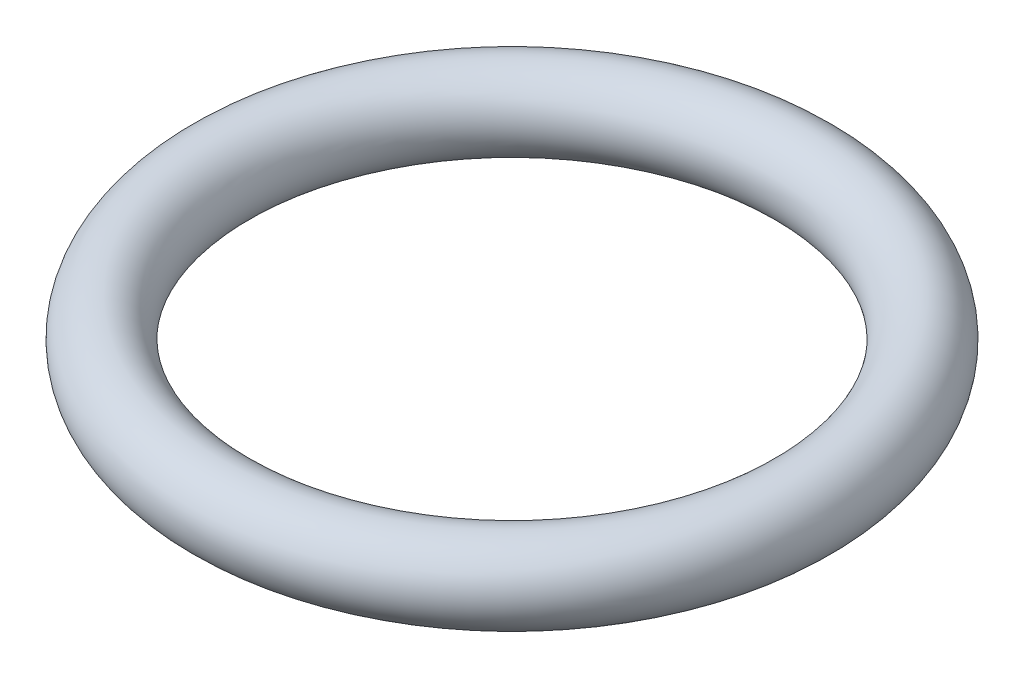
from build123d import *

# Parameters (mm, degrees)
ESBO_O1_R = 0.75


with BuildPart() as part:
    # Esbo_o1 → Revolu_o1 (revolve)
    with BuildSketch(Plane.XY, mode=Mode.PRIVATE) as revolu_o1_sk:
        with Locations((5.55, 0)):
            Circle(ESBO_O1_R)
    revolve(revolu_o1_sk.sketch.rotate(Axis((0, 0, 0), (0, 1, 0)), 90), axis=Axis((0, 0, 0), (0, 1, 0)))


solid = part.part
